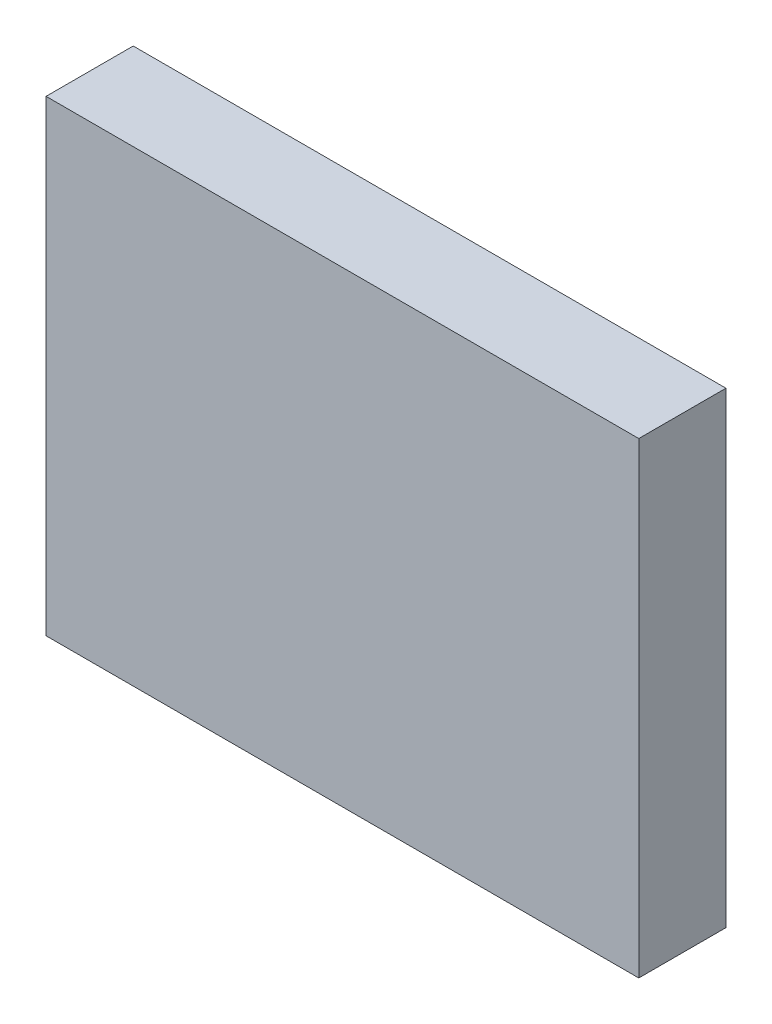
from build123d import *

# Parameters (mm, degrees)
SKETCH1_W           = 67000
SKETCH1_H           = 85000
BOSS_EXTRUDE1_DEPTH = 12500


with BuildPart() as part:
    # Sketch1 → Boss-Extrude1 (new body)
    with BuildSketch(Plane(origin=(0, 0, 0), x_dir=(0, 1, 0), z_dir=(0, 0, 1))):
        Rectangle(SKETCH1_W, SKETCH1_H)
    extrude(amount=-BOSS_EXTRUDE1_DEPTH)


solid = part.part
